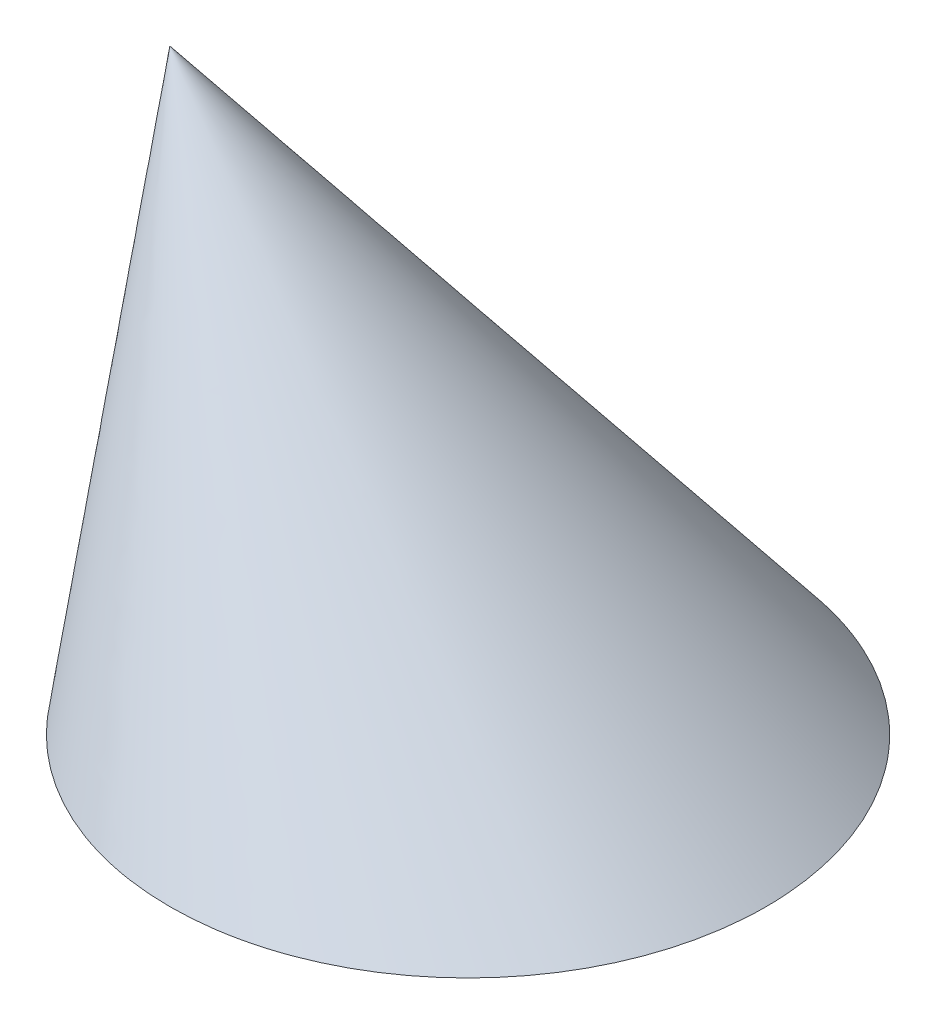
ISO-10303-21;
HEADER;
FILE_DESCRIPTION(('STEP AP214'),'2;1');
FILE_NAME('part.step','',(''),(''),'','','');
FILE_SCHEMA(('AUTOMOTIVE_DESIGN { 1 0 10303 214 1 1 1 1 }'));
ENDSEC;
DATA;
#1=APPLICATION_CONTEXT('core data for automotive mechanical design processes');
#2=APPLICATION_PROTOCOL_DEFINITION('international standard','automotive_design',2000,#1);
#3=PRODUCT_CONTEXT('',#1,'mechanical');
#4=PRODUCT('Part','Part','',(#3));
#5=PRODUCT_RELATED_PRODUCT_CATEGORY('part','',(#4));
#6=PRODUCT_DEFINITION_FORMATION('','',#4);
#7=PRODUCT_DEFINITION_CONTEXT('part definition',#1,'design');
#8=PRODUCT_DEFINITION('design','',#6,#7);
#9=PRODUCT_DEFINITION_SHAPE('','',#8);
#10=(LENGTH_UNIT() NAMED_UNIT(*) SI_UNIT(.MILLI.,.METRE.));
#11=(NAMED_UNIT(*) PLANE_ANGLE_UNIT() SI_UNIT($,.RADIAN.));
#12=(NAMED_UNIT(*) SI_UNIT($,.STERADIAN.) SOLID_ANGLE_UNIT());
#13=UNCERTAINTY_MEASURE_WITH_UNIT(LENGTH_MEASURE(1.E-05),#10,'distance_accuracy_value','');
#14=(GEOMETRIC_REPRESENTATION_CONTEXT(3) GLOBAL_UNCERTAINTY_ASSIGNED_CONTEXT((#13)) GLOBAL_UNIT_ASSIGNED_CONTEXT((#10,
#11,#12)) REPRESENTATION_CONTEXT('',''));
#15=CARTESIAN_POINT('',(0.,0.,0.));
#16=DIRECTION('',(0.,0.,1.));
#17=DIRECTION('',(1.,0.,0.));
#18=AXIS2_PLACEMENT_3D('',#15,#16,#17);
#19=CARTESIAN_POINT('',(0.,0.,0.));
#20=DIRECTION('',(0.,1.,0.));
#21=DIRECTION('',(0.,0.,1.));
#22=AXIS2_PLACEMENT_3D('',#19,#20,#21);
#23=PLANE('',#22);
#24=CARTESIAN_POINT('',(0.,0.,0.));
#25=DIRECTION('',(0.,1.,0.));
#26=DIRECTION('',(0.,0.,1.));
#27=AXIS2_PLACEMENT_3D('',#24,#25,#26);
#28=CIRCLE('',#27,1000.);
#29=CARTESIAN_POINT('',(0.,0.,1000.));
#30=VERTEX_POINT('',#29);
#31=EDGE_CURVE('E12',#30,#30,#28,.T.);
#32=ORIENTED_EDGE('',*,*,#31,.F.);
#33=EDGE_LOOP('',(#32));
#34=FACE_BOUND('',#33,.T.);
#35=ADVANCED_FACE('F39',(#34),#23,.F.);
#36=CARTESIAN_POINT('',(0.,0.,1000.));
#37=CARTESIAN_POINT('',(-1000.,1500.,0.));
#38=CARTESIAN_POINT('',(16.3489492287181,0.,1000.));
#39=CARTESIAN_POINT('',(-1000.,1500.,0.));
#40=CARTESIAN_POINT('',(33.3191001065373,0.,999.600666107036));
#41=CARTESIAN_POINT('',(-1000.,1500.,0.));
#42=CARTESIAN_POINT('',(68.5806992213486,0.,997.801754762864));
#43=CARTESIAN_POINT('',(-1000.,1500.,0.));
#44=CARTESIAN_POINT('',(86.8724128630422,0.,996.402396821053));
#45=CARTESIAN_POINT('',(-1000.,1500.,0.));
#46=CARTESIAN_POINT('',(124.844367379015,0.,992.360033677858));
#47=CARTESIAN_POINT('',(-1000.,1500.,0.));
#48=CARTESIAN_POINT('',(144.52498517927,0.,989.717246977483));
#49=CARTESIAN_POINT('',(-1000.,1500.,0.));
#50=CARTESIAN_POINT('',(185.320429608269,0.,982.89574150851));
#51=CARTESIAN_POINT('',(-1000.,1500.,0.));
#52=CARTESIAN_POINT('',(206.435776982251,0.,978.717210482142));
#53=CARTESIAN_POINT('',(-1000.,1500.,0.));
#54=CARTESIAN_POINT('',(250.111478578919,0.,968.476822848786));
#55=CARTESIAN_POINT('',(-1000.,1500.,0.));
#56=CARTESIAN_POINT('',(272.672530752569,0.,962.415072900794));
#57=CARTESIAN_POINT('',(-1000.,1500.,0.));
#58=CARTESIAN_POINT('',(319.197404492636,0.,948.001106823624));
#59=CARTESIAN_POINT('',(-1000.,1500.,0.));
#60=CARTESIAN_POINT('',(343.162127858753,0.,939.6488371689));
#61=CARTESIAN_POINT('',(-1000.,1500.,0.));
#62=CARTESIAN_POINT('',(380.071906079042,0.,925.051561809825));
#63=CARTESIAN_POINT('',(-1000.,1500.,0.));
#64=CARTESIAN_POINT('',(392.53492751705,0.,919.840519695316));
#65=CARTESIAN_POINT('',(-1000.,1500.,0.));
#66=CARTESIAN_POINT('',(417.75576591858,0.,908.664058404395));
#67=CARTESIAN_POINT('',(-1000.,1500.,0.));
#68=CARTESIAN_POINT('',(430.513620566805,0.,902.698623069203));
#69=CARTESIAN_POINT('',(-1000.,1500.,0.));
#70=CARTESIAN_POINT('',(456.291681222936,0.,889.946449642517));
#71=CARTESIAN_POINT('',(-1000.,1500.,0.));
#72=CARTESIAN_POINT('',(469.311927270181,0.,883.15968798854));
#73=CARTESIAN_POINT('',(-1000.,1500.,0.));
#74=CARTESIAN_POINT('',(495.573372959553,0.,868.695430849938));
#75=CARTESIAN_POINT('',(-1000.,1500.,0.));
#76=CARTESIAN_POINT('',(508.814614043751,0.,861.017902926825));
#77=CARTESIAN_POINT('',(-1000.,1500.,0.));
#78=CARTESIAN_POINT('',(535.466472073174,0.,844.701010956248));
#79=CARTESIAN_POINT('',(-1000.,1500.,0.));
#80=CARTESIAN_POINT('',(548.877130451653,0.,836.061604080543));
#81=CARTESIAN_POINT('',(-1000.,1500.,0.));
#82=CARTESIAN_POINT('',(575.804816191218,0.,817.74930376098));
#83=CARTESIAN_POINT('',(-1000.,1500.,0.));
#84=CARTESIAN_POINT('',(589.321883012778,0.,808.076355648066));
#85=CARTESIAN_POINT('',(-1000.,1500.,0.));
#86=CARTESIAN_POINT('',(616.386727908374,0.,787.626231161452));
#87=CARTESIAN_POINT('',(-1000.,1500.,0.));
#88=CARTESIAN_POINT('',(629.934540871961,0.,776.848987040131));
#89=CARTESIAN_POINT('',(-1000.,1500.,0.));
#90=CARTESIAN_POINT('',(656.971443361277,0.,754.122269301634));
#91=CARTESIAN_POINT('',(-1000.,1500.,0.));
#92=CARTESIAN_POINT('',(670.460559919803,0.,742.172714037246));
#93=CARTESIAN_POINT('',(-1000.,1500.,0.));
#94=CARTESIAN_POINT('',(697.275915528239,0.,717.03835148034));
#95=CARTESIAN_POINT('',(-1000.,1500.,0.));
#96=CARTESIAN_POINT('',(710.602169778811,0.,703.853448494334));
#97=CARTESIAN_POINT('',(-1000.,1500.,0.));
#98=CARTESIAN_POINT('',(736.972277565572,0.,676.193007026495));
#99=CARTESIAN_POINT('',(-1000.,1500.,0.));
#100=CARTESIAN_POINT('',(750.016129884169,0.,661.717359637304));
#101=CARTESIAN_POINT('',(-1000.,1500.,0.));
#102=CARTESIAN_POINT('',(775.686313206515,0.,631.430758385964));
#103=CARTESIAN_POINT('',(-1000.,1500.,0.));
#104=CARTESIAN_POINT('',(788.312621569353,0.,615.619684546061));
#105=CARTESIAN_POINT('',(-1000.,1500.,0.));
#106=CARTESIAN_POINT('',(812.997336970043,0.,582.631715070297));
#107=CARTESIAN_POINT('',(-1000.,1500.,0.));
#108=CARTESIAN_POINT('',(825.055694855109,0.,565.454692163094));
#109=CARTESIAN_POINT('',(-1000.,1500.,0.));
#110=CARTESIAN_POINT('',(848.439926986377,0.,529.722190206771));
#111=CARTESIAN_POINT('',(-1000.,1500.,0.));
#112=CARTESIAN_POINT('',(859.765720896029,0.,511.166582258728));
#113=CARTESIAN_POINT('',(-1000.,1500.,0.));
#114=CARTESIAN_POINT('',(881.507965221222,0.,472.686023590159));
#115=CARTESIAN_POINT('',(-1000.,1500.,0.));
#116=CARTESIAN_POINT('',(891.924300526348,0.,452.760950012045));
#117=CARTESIAN_POINT('',(-1000.,1500.,0.));
#118=CARTESIAN_POINT('',(911.661409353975,0.,411.576129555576));
#119=CARTESIAN_POINT('',(-1000.,1500.,0.));
#120=CARTESIAN_POINT('',(920.98203128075,0.,390.316275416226));
#121=CARTESIAN_POINT('',(-1000.,1500.,0.));
#122=CARTESIAN_POINT('',(938.336132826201,0.,346.525610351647));
#123=CARTESIAN_POINT('',(-1000.,1500.,0.));
#124=CARTESIAN_POINT('',(946.369425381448,0.,323.994718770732));
#125=CARTESIAN_POINT('',(-1000.,1500.,0.));
#126=CARTESIAN_POINT('',(960.957012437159,0.,277.757605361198));
#127=CARTESIAN_POINT('',(-1000.,1500.,0.));
#128=CARTESIAN_POINT('',(967.511088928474,0.,254.051341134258));
#129=CARTESIAN_POINT('',(-1000.,1500.,0.));
#130=CARTESIAN_POINT('',(978.954210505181,0.,205.592910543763));
#131=CARTESIAN_POINT('',(-1000.,1500.,0.));
#132=CARTESIAN_POINT('',(983.843015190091,0.,180.840751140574));
#133=CARTESIAN_POINT('',(-1000.,1500.,0.));
#134=CARTESIAN_POINT('',(991.782295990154,0.,130.454333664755));
#135=CARTESIAN_POINT('',(-1000.,1500.,0.));
#136=CARTESIAN_POINT('',(994.832521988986,0.,104.820140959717));
#137=CARTESIAN_POINT('',(-1000.,1500.,0.));
#138=CARTESIAN_POINT('',(998.941495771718,0.,52.8667833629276));
#139=CARTESIAN_POINT('',(-1000.,1500.,0.));
#140=CARTESIAN_POINT('',(1000.,0.,26.5477476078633));
#141=CARTESIAN_POINT('',(-1000.,1500.,0.));
#142=CARTESIAN_POINT('',(1000.,0.,-26.5477476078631));
#143=CARTESIAN_POINT('',(-1000.,1500.,0.));
#144=CARTESIAN_POINT('',(998.941495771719,0.,-52.8667833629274));
#145=CARTESIAN_POINT('',(-1000.,1500.,0.));
#146=CARTESIAN_POINT('',(994.832521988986,0.,-104.820140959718));
#147=CARTESIAN_POINT('',(-1000.,1500.,0.));
#148=CARTESIAN_POINT('',(991.782295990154,0.,-130.454333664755));
#149=CARTESIAN_POINT('',(-1000.,1500.,0.));
#150=CARTESIAN_POINT('',(983.843015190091,0.,-180.840751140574));
#151=CARTESIAN_POINT('',(-1000.,1500.,0.));
#152=CARTESIAN_POINT('',(978.95421050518,0.,-205.592910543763));
#153=CARTESIAN_POINT('',(-1000.,1500.,0.));
#154=CARTESIAN_POINT('',(967.511088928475,0.,-254.051341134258));
#155=CARTESIAN_POINT('',(-1000.,1500.,0.));
#156=CARTESIAN_POINT('',(960.957012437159,0.,-277.757605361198));
#157=CARTESIAN_POINT('',(-1000.,1500.,0.));
#158=CARTESIAN_POINT('',(946.369425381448,0.,-323.994718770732));
#159=CARTESIAN_POINT('',(-1000.,1500.,0.));
#160=CARTESIAN_POINT('',(938.336132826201,0.,-346.525610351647));
#161=CARTESIAN_POINT('',(-1000.,1500.,0.));
#162=CARTESIAN_POINT('',(920.98203128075,0.,-390.316275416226));
#163=CARTESIAN_POINT('',(-1000.,1500.,0.));
#164=CARTESIAN_POINT('',(911.661409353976,0.,-411.576129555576));
#165=CARTESIAN_POINT('',(-1000.,1500.,0.));
#166=CARTESIAN_POINT('',(891.924300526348,0.,-452.760950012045));
#167=CARTESIAN_POINT('',(-1000.,1500.,0.));
#168=CARTESIAN_POINT('',(881.507965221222,0.,-472.686023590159));
#169=CARTESIAN_POINT('',(-1000.,1500.,0.));
#170=CARTESIAN_POINT('',(859.765720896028,0.,-511.166582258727));
#171=CARTESIAN_POINT('',(-1000.,1500.,0.));
#172=CARTESIAN_POINT('',(848.439926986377,0.,-529.722190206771));
#173=CARTESIAN_POINT('',(-1000.,1500.,0.));
#174=CARTESIAN_POINT('',(825.05569485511,0.,-565.454692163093));
#175=CARTESIAN_POINT('',(-1000.,1500.,0.));
#176=CARTESIAN_POINT('',(812.997336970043,0.,-582.631715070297));
#177=CARTESIAN_POINT('',(-1000.,1500.,0.));
#178=CARTESIAN_POINT('',(788.312621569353,0.,-615.619684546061));
#179=CARTESIAN_POINT('',(-1000.,1500.,0.));
#180=CARTESIAN_POINT('',(775.686313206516,0.,-631.430758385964));
#181=CARTESIAN_POINT('',(-1000.,1500.,0.));
#182=CARTESIAN_POINT('',(750.016129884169,0.,-661.717359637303));
#183=CARTESIAN_POINT('',(-1000.,1500.,0.));
#184=CARTESIAN_POINT('',(736.972277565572,0.,-676.193007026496));
#185=CARTESIAN_POINT('',(-1000.,1500.,0.));
#186=CARTESIAN_POINT('',(710.602169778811,0.,-703.853448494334));
#187=CARTESIAN_POINT('',(-1000.,1500.,0.));
#188=CARTESIAN_POINT('',(697.275915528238,0.,-717.03835148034));
#189=CARTESIAN_POINT('',(-1000.,1500.,0.));
#190=CARTESIAN_POINT('',(670.460559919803,0.,-742.172714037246));
#191=CARTESIAN_POINT('',(-1000.,1500.,0.));
#192=CARTESIAN_POINT('',(656.971443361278,0.,-754.122269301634));
#193=CARTESIAN_POINT('',(-1000.,1500.,0.));
#194=CARTESIAN_POINT('',(629.934540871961,0.,-776.84898704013));
#195=CARTESIAN_POINT('',(-1000.,1500.,0.));
#196=CARTESIAN_POINT('',(616.386727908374,0.,-787.626231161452));
#197=CARTESIAN_POINT('',(-1000.,1500.,0.));
#198=CARTESIAN_POINT('',(589.321883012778,0.,-808.076355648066));
#199=CARTESIAN_POINT('',(-1000.,1500.,0.));
#200=CARTESIAN_POINT('',(575.804816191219,0.,-817.74930376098));
#201=CARTESIAN_POINT('',(-1000.,1500.,0.));
#202=CARTESIAN_POINT('',(548.877130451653,0.,-836.061604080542));
#203=CARTESIAN_POINT('',(-1000.,1500.,0.));
#204=CARTESIAN_POINT('',(535.466472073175,0.,-844.701010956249));
#205=CARTESIAN_POINT('',(-1000.,1500.,0.));
#206=CARTESIAN_POINT('',(508.814614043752,0.,-861.017902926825));
#207=CARTESIAN_POINT('',(-1000.,1500.,0.));
#208=CARTESIAN_POINT('',(495.573372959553,0.,-868.695430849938));
#209=CARTESIAN_POINT('',(-1000.,1500.,0.));
#210=CARTESIAN_POINT('',(469.311927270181,0.,-883.15968798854));
#211=CARTESIAN_POINT('',(-1000.,1500.,0.));
#212=CARTESIAN_POINT('',(456.291681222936,0.,-889.946449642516));
#213=CARTESIAN_POINT('',(-1000.,1500.,0.));
#214=CARTESIAN_POINT('',(430.513620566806,0.,-902.698623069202));
#215=CARTESIAN_POINT('',(-1000.,1500.,0.));
#216=CARTESIAN_POINT('',(417.75576591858,0.,-908.664058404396));
#217=CARTESIAN_POINT('',(-1000.,1500.,0.));
#218=CARTESIAN_POINT('',(392.534927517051,0.,-919.840519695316));
#219=CARTESIAN_POINT('',(-1000.,1500.,0.));
#220=CARTESIAN_POINT('',(380.071906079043,0.,-925.051561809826));
#221=CARTESIAN_POINT('',(-1000.,1500.,0.));
#222=CARTESIAN_POINT('',(343.162127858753,0.,-939.6488371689));
#223=CARTESIAN_POINT('',(-1000.,1500.,0.));
#224=CARTESIAN_POINT('',(319.197404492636,0.,-948.001106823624));
#225=CARTESIAN_POINT('',(-1000.,1500.,0.));
#226=CARTESIAN_POINT('',(272.672530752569,0.,-962.415072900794));
#227=CARTESIAN_POINT('',(-1000.,1500.,0.));
#228=CARTESIAN_POINT('',(250.111478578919,0.,-968.476822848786));
#229=CARTESIAN_POINT('',(-1000.,1500.,0.));
#230=CARTESIAN_POINT('',(206.435776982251,0.,-978.717210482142));
#231=CARTESIAN_POINT('',(-1000.,1500.,0.));
#232=CARTESIAN_POINT('',(185.320429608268,0.,-982.895741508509));
#233=CARTESIAN_POINT('',(-1000.,1500.,0.));
#234=CARTESIAN_POINT('',(144.52498517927,0.,-989.717246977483));
#235=CARTESIAN_POINT('',(-1000.,1500.,0.));
#236=CARTESIAN_POINT('',(124.844367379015,0.,-992.360033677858));
#237=CARTESIAN_POINT('',(-1000.,1500.,0.));
#238=CARTESIAN_POINT('',(86.8724128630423,0.,-996.402396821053));
#239=CARTESIAN_POINT('',(-1000.,1500.,0.));
#240=CARTESIAN_POINT('',(68.5806992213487,0.,-997.801754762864));
#241=CARTESIAN_POINT('',(-1000.,1500.,0.));
#242=CARTESIAN_POINT('',(33.3191001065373,0.,-999.600666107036));
#243=CARTESIAN_POINT('',(-1000.,1500.,0.));
#244=CARTESIAN_POINT('',(16.3489492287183,0.,-1000.));
#245=CARTESIAN_POINT('',(-1000.,1500.,0.));
#246=CARTESIAN_POINT('',(-16.3489492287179,0.,-1000.));
#247=CARTESIAN_POINT('',(-1000.,1500.,0.));
#248=CARTESIAN_POINT('',(-33.3191001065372,0.,-999.600666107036));
#249=CARTESIAN_POINT('',(-1000.,1500.,0.));
#250=CARTESIAN_POINT('',(-68.5806992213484,0.,-997.801754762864));
#251=CARTESIAN_POINT('',(-1000.,1500.,0.));
#252=CARTESIAN_POINT('',(-86.8724128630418,0.,-996.402396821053));
#253=CARTESIAN_POINT('',(-1000.,1500.,0.));
#254=CARTESIAN_POINT('',(-124.844367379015,0.,-992.360033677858));
#255=CARTESIAN_POINT('',(-1000.,1500.,0.));
#256=CARTESIAN_POINT('',(-144.52498517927,0.,-989.717246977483));
#257=CARTESIAN_POINT('',(-1000.,1500.,0.));
#258=CARTESIAN_POINT('',(-185.320429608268,0.,-982.895741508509));
#259=CARTESIAN_POINT('',(-1000.,1500.,0.));
#260=CARTESIAN_POINT('',(-206.435776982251,0.,-978.717210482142));
#261=CARTESIAN_POINT('',(-1000.,1500.,0.));
#262=CARTESIAN_POINT('',(-250.111478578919,0.,-968.476822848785));
#263=CARTESIAN_POINT('',(-1000.,1500.,0.));
#264=CARTESIAN_POINT('',(-272.672530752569,0.,-962.415072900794));
#265=CARTESIAN_POINT('',(-1000.,1500.,0.));
#266=CARTESIAN_POINT('',(-319.197404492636,0.,-948.001106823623));
#267=CARTESIAN_POINT('',(-1000.,1500.,0.));
#268=CARTESIAN_POINT('',(-343.162127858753,0.,-939.6488371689));
#269=CARTESIAN_POINT('',(-1000.,1500.,0.));
#270=CARTESIAN_POINT('',(-380.071906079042,0.,-925.051561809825));
#271=CARTESIAN_POINT('',(-1000.,1500.,0.));
#272=CARTESIAN_POINT('',(-392.53492751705,0.,-919.840519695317));
#273=CARTESIAN_POINT('',(-1000.,1500.,0.));
#274=CARTESIAN_POINT('',(-417.755765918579,0.,-908.664058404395));
#275=CARTESIAN_POINT('',(-1000.,1500.,0.));
#276=CARTESIAN_POINT('',(-430.513620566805,0.,-902.698623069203));
#277=CARTESIAN_POINT('',(-1000.,1500.,0.));
#278=CARTESIAN_POINT('',(-456.291681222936,0.,-889.946449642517));
#279=CARTESIAN_POINT('',(-1000.,1500.,0.));
#280=CARTESIAN_POINT('',(-469.311927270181,0.,-883.15968798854));
#281=CARTESIAN_POINT('',(-1000.,1500.,0.));
#282=CARTESIAN_POINT('',(-495.573372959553,0.,-868.695430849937));
#283=CARTESIAN_POINT('',(-1000.,1500.,0.));
#284=CARTESIAN_POINT('',(-508.814614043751,0.,-861.017902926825));
#285=CARTESIAN_POINT('',(-1000.,1500.,0.));
#286=CARTESIAN_POINT('',(-535.466472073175,0.,-844.701010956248));
#287=CARTESIAN_POINT('',(-1000.,1500.,0.));
#288=CARTESIAN_POINT('',(-548.877130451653,0.,-836.061604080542));
#289=CARTESIAN_POINT('',(-1000.,1500.,0.));
#290=CARTESIAN_POINT('',(-575.804816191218,0.,-817.74930376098));
#291=CARTESIAN_POINT('',(-1000.,1500.,0.));
#292=CARTESIAN_POINT('',(-589.321883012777,0.,-808.076355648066));
#293=CARTESIAN_POINT('',(-1000.,1500.,0.));
#294=CARTESIAN_POINT('',(-616.386727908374,0.,-787.626231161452));
#295=CARTESIAN_POINT('',(-1000.,1500.,0.));
#296=CARTESIAN_POINT('',(-629.934540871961,0.,-776.84898704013));
#297=CARTESIAN_POINT('',(-1000.,1500.,0.));
#298=CARTESIAN_POINT('',(-656.971443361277,0.,-754.122269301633));
#299=CARTESIAN_POINT('',(-1000.,1500.,0.));
#300=CARTESIAN_POINT('',(-670.460559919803,0.,-742.172714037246));
#301=CARTESIAN_POINT('',(-1000.,1500.,0.));
#302=CARTESIAN_POINT('',(-697.275915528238,0.,-717.03835148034));
#303=CARTESIAN_POINT('',(-1000.,1500.,0.));
#304=CARTESIAN_POINT('',(-710.602169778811,0.,-703.853448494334));
#305=CARTESIAN_POINT('',(-1000.,1500.,0.));
#306=CARTESIAN_POINT('',(-736.972277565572,0.,-676.193007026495));
#307=CARTESIAN_POINT('',(-1000.,1500.,0.));
#308=CARTESIAN_POINT('',(-750.016129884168,0.,-661.717359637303));
#309=CARTESIAN_POINT('',(-1000.,1500.,0.));
#310=CARTESIAN_POINT('',(-775.686313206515,0.,-631.430758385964));
#311=CARTESIAN_POINT('',(-1000.,1500.,0.));
#312=CARTESIAN_POINT('',(-788.312621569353,0.,-615.619684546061));
#313=CARTESIAN_POINT('',(-1000.,1500.,0.));
#314=CARTESIAN_POINT('',(-812.997336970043,0.,-582.631715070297));
#315=CARTESIAN_POINT('',(-1000.,1500.,0.));
#316=CARTESIAN_POINT('',(-825.055694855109,0.,-565.454692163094));
#317=CARTESIAN_POINT('',(-1000.,1500.,0.));
#318=CARTESIAN_POINT('',(-848.439926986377,0.,-529.722190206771));
#319=CARTESIAN_POINT('',(-1000.,1500.,0.));
#320=CARTESIAN_POINT('',(-859.765720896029,0.,-511.166582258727));
#321=CARTESIAN_POINT('',(-1000.,1500.,0.));
#322=CARTESIAN_POINT('',(-881.507965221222,0.,-472.686023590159));
#323=CARTESIAN_POINT('',(-1000.,1500.,0.));
#324=CARTESIAN_POINT('',(-891.924300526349,0.,-452.760950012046));
#325=CARTESIAN_POINT('',(-1000.,1500.,0.));
#326=CARTESIAN_POINT('',(-911.661409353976,0.,-411.576129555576));
#327=CARTESIAN_POINT('',(-1000.,1500.,0.));
#328=CARTESIAN_POINT('',(-920.98203128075,0.,-390.316275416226));
#329=CARTESIAN_POINT('',(-1000.,1500.,0.));
#330=CARTESIAN_POINT('',(-938.336132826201,0.,-346.525610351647));
#331=CARTESIAN_POINT('',(-1000.,1500.,0.));
#332=CARTESIAN_POINT('',(-946.369425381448,0.,-323.994718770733));
#333=CARTESIAN_POINT('',(-1000.,1500.,0.));
#334=CARTESIAN_POINT('',(-960.957012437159,0.,-277.757605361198));
#335=CARTESIAN_POINT('',(-1000.,1500.,0.));
#336=CARTESIAN_POINT('',(-967.511088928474,0.,-254.051341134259));
#337=CARTESIAN_POINT('',(-1000.,1500.,0.));
#338=CARTESIAN_POINT('',(-978.95421050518,0.,-205.592910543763));
#339=CARTESIAN_POINT('',(-1000.,1500.,0.));
#340=CARTESIAN_POINT('',(-983.843015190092,0.,-180.840751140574));
#341=CARTESIAN_POINT('',(-1000.,1500.,0.));
#342=CARTESIAN_POINT('',(-991.782295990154,0.,-130.454333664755));
#343=CARTESIAN_POINT('',(-1000.,1500.,0.));
#344=CARTESIAN_POINT('',(-994.832521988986,0.,-104.820140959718));
#345=CARTESIAN_POINT('',(-1000.,1500.,0.));
#346=CARTESIAN_POINT('',(-998.941495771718,0.,-52.8667833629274));
#347=CARTESIAN_POINT('',(-1000.,1500.,0.));
#348=CARTESIAN_POINT('',(-1000.,0.,-26.5477476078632));
#349=CARTESIAN_POINT('',(-1000.,1500.,0.));
#350=CARTESIAN_POINT('',(-1000.,0.,26.5477476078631));
#351=CARTESIAN_POINT('',(-1000.,1500.,0.));
#352=CARTESIAN_POINT('',(-998.941495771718,0.,52.8667833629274));
#353=CARTESIAN_POINT('',(-1000.,1500.,0.));
#354=CARTESIAN_POINT('',(-994.832521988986,0.,104.820140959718));
#355=CARTESIAN_POINT('',(-1000.,1500.,0.));
#356=CARTESIAN_POINT('',(-991.782295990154,0.,130.454333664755));
#357=CARTESIAN_POINT('',(-1000.,1500.,0.));
#358=CARTESIAN_POINT('',(-983.843015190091,0.,180.840751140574));
#359=CARTESIAN_POINT('',(-1000.,1500.,0.));
#360=CARTESIAN_POINT('',(-978.954210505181,0.,205.592910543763));
#361=CARTESIAN_POINT('',(-1000.,1500.,0.));
#362=CARTESIAN_POINT('',(-967.511088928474,0.,254.051341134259));
#363=CARTESIAN_POINT('',(-1000.,1500.,0.));
#364=CARTESIAN_POINT('',(-960.957012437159,0.,277.757605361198));
#365=CARTESIAN_POINT('',(-1000.,1500.,0.));
#366=CARTESIAN_POINT('',(-946.369425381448,0.,323.994718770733));
#367=CARTESIAN_POINT('',(-1000.,1500.,0.));
#368=CARTESIAN_POINT('',(-938.336132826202,0.,346.525610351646));
#369=CARTESIAN_POINT('',(-1000.,1500.,0.));
#370=CARTESIAN_POINT('',(-920.98203128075,0.,390.316275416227));
#371=CARTESIAN_POINT('',(-1000.,1500.,0.));
#372=CARTESIAN_POINT('',(-911.661409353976,0.,411.576129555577));
#373=CARTESIAN_POINT('',(-1000.,1500.,0.));
#374=CARTESIAN_POINT('',(-891.924300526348,0.,452.760950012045));
#375=CARTESIAN_POINT('',(-1000.,1500.,0.));
#376=CARTESIAN_POINT('',(-881.507965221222,0.,472.686023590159));
#377=CARTESIAN_POINT('',(-1000.,1500.,0.));
#378=CARTESIAN_POINT('',(-859.765720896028,0.,511.166582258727));
#379=CARTESIAN_POINT('',(-1000.,1500.,0.));
#380=CARTESIAN_POINT('',(-848.439926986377,0.,529.722190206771));
#381=CARTESIAN_POINT('',(-1000.,1500.,0.));
#382=CARTESIAN_POINT('',(-825.055694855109,0.,565.454692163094));
#383=CARTESIAN_POINT('',(-1000.,1500.,0.));
#384=CARTESIAN_POINT('',(-812.997336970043,0.,582.631715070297));
#385=CARTESIAN_POINT('',(-1000.,1500.,0.));
#386=CARTESIAN_POINT('',(-788.312621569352,0.,615.619684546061));
#387=CARTESIAN_POINT('',(-1000.,1500.,0.));
#388=CARTESIAN_POINT('',(-775.686313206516,0.,631.430758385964));
#389=CARTESIAN_POINT('',(-1000.,1500.,0.));
#390=CARTESIAN_POINT('',(-750.016129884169,0.,661.717359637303));
#391=CARTESIAN_POINT('',(-1000.,1500.,0.));
#392=CARTESIAN_POINT('',(-736.972277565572,0.,676.193007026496));
#393=CARTESIAN_POINT('',(-1000.,1500.,0.));
#394=CARTESIAN_POINT('',(-710.602169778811,0.,703.853448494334));
#395=CARTESIAN_POINT('',(-1000.,1500.,0.));
#396=CARTESIAN_POINT('',(-697.275915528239,0.,717.038351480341));
#397=CARTESIAN_POINT('',(-1000.,1500.,0.));
#398=CARTESIAN_POINT('',(-670.460559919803,0.,742.172714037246));
#399=CARTESIAN_POINT('',(-1000.,1500.,0.));
#400=CARTESIAN_POINT('',(-656.971443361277,0.,754.122269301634));
#401=CARTESIAN_POINT('',(-1000.,1500.,0.));
#402=CARTESIAN_POINT('',(-629.934540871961,0.,776.84898704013));
#403=CARTESIAN_POINT('',(-1000.,1500.,0.));
#404=CARTESIAN_POINT('',(-616.386727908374,0.,787.626231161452));
#405=CARTESIAN_POINT('',(-1000.,1500.,0.));
#406=CARTESIAN_POINT('',(-589.321883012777,0.,808.076355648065));
#407=CARTESIAN_POINT('',(-1000.,1500.,0.));
#408=CARTESIAN_POINT('',(-575.804816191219,0.,817.749303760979));
#409=CARTESIAN_POINT('',(-1000.,1500.,0.));
#410=CARTESIAN_POINT('',(-548.877130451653,0.,836.061604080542));
#411=CARTESIAN_POINT('',(-1000.,1500.,0.));
#412=CARTESIAN_POINT('',(-535.466472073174,0.,844.701010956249));
#413=CARTESIAN_POINT('',(-1000.,1500.,0.));
#414=CARTESIAN_POINT('',(-508.814614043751,0.,861.017902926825));
#415=CARTESIAN_POINT('',(-1000.,1500.,0.));
#416=CARTESIAN_POINT('',(-495.573372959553,0.,868.695430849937));
#417=CARTESIAN_POINT('',(-1000.,1500.,0.));
#418=CARTESIAN_POINT('',(-469.311927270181,0.,883.15968798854));
#419=CARTESIAN_POINT('',(-1000.,1500.,0.));
#420=CARTESIAN_POINT('',(-456.291681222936,0.,889.946449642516));
#421=CARTESIAN_POINT('',(-1000.,1500.,0.));
#422=CARTESIAN_POINT('',(-430.513620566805,0.,902.698623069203));
#423=CARTESIAN_POINT('',(-1000.,1500.,0.));
#424=CARTESIAN_POINT('',(-417.75576591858,0.,908.664058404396));
#425=CARTESIAN_POINT('',(-1000.,1500.,0.));
#426=CARTESIAN_POINT('',(-392.53492751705,0.,919.840519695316));
#427=CARTESIAN_POINT('',(-1000.,1500.,0.));
#428=CARTESIAN_POINT('',(-380.071906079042,0.,925.051561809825));
#429=CARTESIAN_POINT('',(-1000.,1500.,0.));
#430=CARTESIAN_POINT('',(-343.162127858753,0.,939.6488371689));
#431=CARTESIAN_POINT('',(-1000.,1500.,0.));
#432=CARTESIAN_POINT('',(-319.197404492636,0.,948.001106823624));
#433=CARTESIAN_POINT('',(-1000.,1500.,0.));
#434=CARTESIAN_POINT('',(-272.672530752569,0.,962.415072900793));
#435=CARTESIAN_POINT('',(-1000.,1500.,0.));
#436=CARTESIAN_POINT('',(-250.111478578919,0.,968.476822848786));
#437=CARTESIAN_POINT('',(-1000.,1500.,0.));
#438=CARTESIAN_POINT('',(-206.435776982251,0.,978.717210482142));
#439=CARTESIAN_POINT('',(-1000.,1500.,0.));
#440=CARTESIAN_POINT('',(-185.320429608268,0.,982.895741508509));
#441=CARTESIAN_POINT('',(-1000.,1500.,0.));
#442=CARTESIAN_POINT('',(-144.52498517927,0.,989.717246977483));
#443=CARTESIAN_POINT('',(-1000.,1500.,0.));
#444=CARTESIAN_POINT('',(-124.844367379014,0.,992.360033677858));
#445=CARTESIAN_POINT('',(-1000.,1500.,0.));
#446=CARTESIAN_POINT('',(-86.8724128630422,0.,996.402396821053));
#447=CARTESIAN_POINT('',(-1000.,1500.,0.));
#448=CARTESIAN_POINT('',(-68.5806992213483,0.,997.801754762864));
#449=CARTESIAN_POINT('',(-1000.,1500.,0.));
#450=CARTESIAN_POINT('',(-33.3191001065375,0.,999.600666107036));
#451=CARTESIAN_POINT('',(-1000.,1500.,0.));
#452=CARTESIAN_POINT('',(-16.3489492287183,0.,1000.));
#453=CARTESIAN_POINT('',(-1000.,1500.,0.));
#454=CARTESIAN_POINT('',(0.,0.,1000.));
#455=CARTESIAN_POINT('',(-1000.,1500.,0.));
#456=B_SPLINE_SURFACE_WITH_KNOTS('',3,1,((#36,#37),(#38,#39),(#40,#41),(#42,#43),(#44,#45),(#46,
#47),(#48,#49),(#50,#51),(#52,#53),(#54,#55),(#56,#57),(#58,#59),(#60,#61),(#62,#63),(#64,#65),
(#66,#67),(#68,#69),(#70,#71),(#72,#73),(#74,#75),(#76,#77),(#78,#79),(#80,#81),(#82,#83),(#84,
#85),(#86,#87),(#88,#89),(#90,#91),(#92,#93),(#94,#95),(#96,#97),(#98,#99),(#100,#101),(#102,
#103),(#104,#105),(#106,#107),(#108,#109),(#110,#111),(#112,#113),(#114,#115),(#116,#117),(#118,
#119),(#120,#121),(#122,#123),(#124,#125),(#126,#127),(#128,#129),(#130,#131),(#132,#133),(#134,
#135),(#136,#137),(#138,#139),(#140,#141),(#142,#143),(#144,#145),(#146,#147),(#148,#149),(#150,
#151),(#152,#153),(#154,#155),(#156,#157),(#158,#159),(#160,#161),(#162,#163),(#164,#165),(#166,
#167),(#168,#169),(#170,#171),(#172,#173),(#174,#175),(#176,#177),(#178,#179),(#180,#181),(#182,
#183),(#184,#185),(#186,#187),(#188,#189),(#190,#191),(#192,#193),(#194,#195),(#196,#197),(#198,
#199),(#200,#201),(#202,#203),(#204,#205),(#206,#207),(#208,#209),(#210,#211),(#212,#213),(#214,
#215),(#216,#217),(#218,#219),(#220,#221),(#222,#223),(#224,#225),(#226,#227),(#228,#229),(#230,
#231),(#232,#233),(#234,#235),(#236,#237),(#238,#239),(#240,#241),(#242,#243),(#244,#245),(#246,
#247),(#248,#249),(#250,#251),(#252,#253),(#254,#255),(#256,#257),(#258,#259),(#260,#261),(#262,
#263),(#264,#265),(#266,#267),(#268,#269),(#270,#271),(#272,#273),(#274,#275),(#276,#277),(#278,
#279),(#280,#281),(#282,#283),(#284,#285),(#286,#287),(#288,#289),(#290,#291),(#292,#293),(#294,
#295),(#296,#297),(#298,#299),(#300,#301),(#302,#303),(#304,#305),(#306,#307),(#308,#309),(#310,
#311),(#312,#313),(#314,#315),(#316,#317),(#318,#319),(#320,#321),(#322,#323),(#324,#325),(#326,
#327),(#328,#329),(#330,#331),(#332,#333),(#334,#335),(#336,#337),(#338,#339),(#340,#341),(#342,
#343),(#344,#345),(#346,#347),(#348,#349),(#350,#351),(#352,#353),(#354,#355),(#356,#357),(#358,
#359),(#360,#361),(#362,#363),(#364,#365),(#366,#367),(#368,#369),(#370,#371),(#372,#373),(#374,
#375),(#376,#377),(#378,#379),(#380,#381),(#382,#383),(#384,#385),(#386,#387),(#388,#389),(#390,
#391),(#392,#393),(#394,#395),(#396,#397),(#398,#399),(#400,#401),(#402,#403),(#404,#405),(#406,
#407),(#408,#409),(#410,#411),(#412,#413),(#414,#415),(#416,#417),(#418,#419),(#420,#421),(#422,
#423),(#424,#425),(#426,#427),(#428,#429),(#430,#431),(#432,#433),(#434,#435),(#436,#437),(#438,
#439),(#440,#441),(#442,#443),(#444,#445),(#446,#447),(#448,#449),(#450,#451),(#452,#453),(#454,
#455)),.UNSPECIFIED.,.T.,.F.,.F.,(4,2,2,2,2,2,2,2,2,2,2,2,2,2,2,2,2,2,2,2,2,2,2,2,2,2,2,2,2,2,2,
2,2,2,2,2,2,2,2,2,2,2,2,2,2,2,2,2,2,2,2,2,2,2,2,2,2,2,2,2,2,2,2,2,2,2,2,2,2,2,2,2,2,2,2,2,2,2,2,
2,2,2,2,2,2,2,2,2,2,2,2,2,2,2,2,2,2,2,2,2,2,2,2,2,4),(2,2),(0.,0.015625,0.03125,
0.0468749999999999,0.0624999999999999,0.0781249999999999,0.0937499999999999,0.1015625,0.109375,
0.1171875,0.125,0.1328125,0.140625,0.1484375,0.15625,0.1640625,0.171875,0.1796875,0.1875,
0.1953125,0.203125,0.2109375,0.21875,0.2265625,0.234375,0.2421875,0.25,0.2578125,0.265625,
0.2734375,0.28125,0.2890625,0.296875,0.3046875,0.3125,0.3203125,0.328125,0.3359375,0.34375,
0.3515625,0.359375,0.3671875,0.375,0.382812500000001,0.390625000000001,0.398437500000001,
0.406250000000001,0.421875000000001,0.437500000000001,0.453125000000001,0.468750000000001,
0.484375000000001,0.500000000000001,0.515625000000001,0.531250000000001,0.546875,0.5625,
0.578125,0.59375,0.6015625,0.609375,0.6171875,0.625,0.6328125,0.640625,0.6484375,0.65625,
0.6640625,0.671875,0.6796875,0.6875,0.6953125,0.703125,0.7109375,0.71875,0.7265625,0.734375,
0.7421875,0.75,0.7578125,0.765625,0.7734375,0.78125,0.7890625,0.796875,0.8046875,0.8125,
0.8203125,0.828125,0.8359375,0.84375,0.8515625,0.859375,0.8671875,0.875,0.8828125,0.890625,
0.8984375,0.90625,0.921875,0.9375,0.953125,0.96875,0.984375,1.),(0.,1.),.UNSPECIFIED.);
#457=CARTESIAN_POINT('',(-1000.,1500.,0.));
#458=VERTEX_POINT('',#457);
#459=VERTEX_LOOP('',#458);
#460=FACE_BOUND('',#459,.T.);
#461=ORIENTED_EDGE('',*,*,#31,.T.);
#462=EDGE_LOOP('',(#461));
#463=FACE_BOUND('',#462,.T.);
#464=ADVANCED_FACE('F41',(#460,#463),#456,.T.);
#465=CLOSED_SHELL('',(#35,#464));
#466=MANIFOLD_SOLID_BREP('B2',#465);
#467=ADVANCED_BREP_SHAPE_REPRESENTATION('',(#18,#466),#14);
#468=SHAPE_DEFINITION_REPRESENTATION(#9,#467);
ENDSEC;
END-ISO-10303-21;
